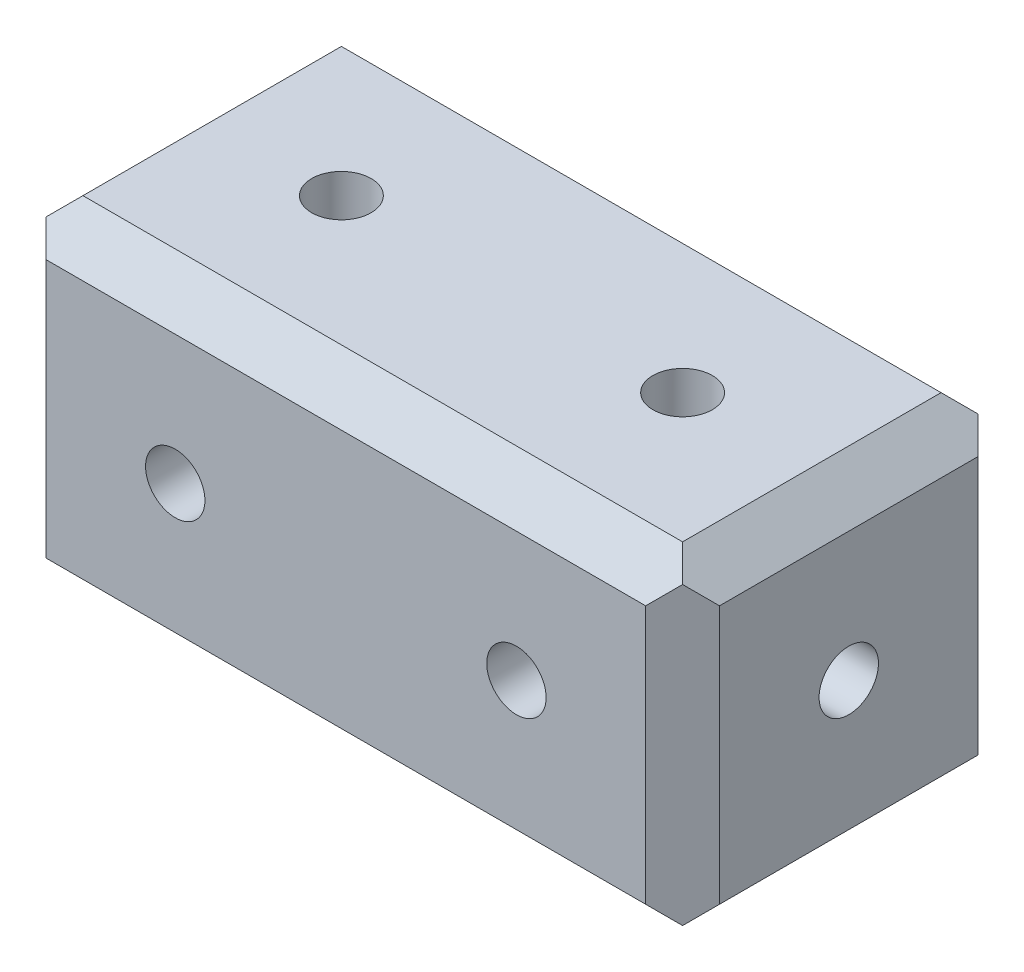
ISO-10303-21;
HEADER;
FILE_DESCRIPTION(('STEP AP214'),'2;1');
FILE_NAME('part.step','',(''),(''),'','','');
FILE_SCHEMA(('AUTOMOTIVE_DESIGN { 1 0 10303 214 1 1 1 1 }'));
ENDSEC;
DATA;
#1=APPLICATION_CONTEXT('core data for automotive mechanical design processes');
#2=APPLICATION_PROTOCOL_DEFINITION('international standard','automotive_design',2000,#1);
#3=PRODUCT_CONTEXT('',#1,'mechanical');
#4=PRODUCT('Part','Part','',(#3));
#5=PRODUCT_RELATED_PRODUCT_CATEGORY('part','',(#4));
#6=PRODUCT_DEFINITION_FORMATION('','',#4);
#7=PRODUCT_DEFINITION_CONTEXT('part definition',#1,'design');
#8=PRODUCT_DEFINITION('design','',#6,#7);
#9=PRODUCT_DEFINITION_SHAPE('','',#8);
#10=(LENGTH_UNIT() NAMED_UNIT(*) SI_UNIT(.MILLI.,.METRE.));
#11=(NAMED_UNIT(*) PLANE_ANGLE_UNIT() SI_UNIT($,.RADIAN.));
#12=(NAMED_UNIT(*) SI_UNIT($,.STERADIAN.) SOLID_ANGLE_UNIT());
#13=UNCERTAINTY_MEASURE_WITH_UNIT(LENGTH_MEASURE(1.E-05),#10,'distance_accuracy_value','');
#14=(GEOMETRIC_REPRESENTATION_CONTEXT(3) GLOBAL_UNCERTAINTY_ASSIGNED_CONTEXT((#13)) GLOBAL_UNIT_ASSIGNED_CONTEXT((#10,
#11,#12)) REPRESENTATION_CONTEXT('',''));
#15=CARTESIAN_POINT('',(0.,0.,0.));
#16=DIRECTION('',(0.,0.,1.));
#17=DIRECTION('',(1.,0.,0.));
#18=AXIS2_PLACEMENT_3D('',#15,#16,#17);
#19=CARTESIAN_POINT('',(0.,14.2875,0.));
#20=DIRECTION('',(0.,1.,0.));
#21=DIRECTION('',(0.,0.,1.));
#22=AXIS2_PLACEMENT_3D('',#19,#20,#21);
#23=CYLINDRICAL_SURFACE('',#22,2.5527);
#24=CARTESIAN_POINT('',(0.,14.2875,0.));
#25=DIRECTION('',(0.,1.,0.));
#26=DIRECTION('',(0.,0.,1.));
#27=AXIS2_PLACEMENT_3D('',#24,#25,#26);
#28=CIRCLE('',#27,2.5527);
#29=CARTESIAN_POINT('',(0.,14.2875,2.5527));
#30=VERTEX_POINT('',#29);
#31=EDGE_CURVE('E565',#30,#30,#28,.T.);
#32=ORIENTED_EDGE('',*,*,#31,.T.);
#33=EDGE_LOOP('',(#32));
#34=FACE_BOUND('',#33,.T.);
#35=CARTESIAN_POINT('',(0.,0.,0.));
#36=DIRECTION('',(0.,0.707106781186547,-0.707106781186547));
#37=DIRECTION('',(0.,0.707106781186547,0.707106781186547));
#38=AXIS2_PLACEMENT_3D('',#35,#36,#37);
#39=ELLIPSE('',#38,3.6100629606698,2.5527);
#40=CARTESIAN_POINT('',(1.8050314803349,1.8050314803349,1.8050314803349));
#41=VERTEX_POINT('',#40);
#42=CARTESIAN_POINT('',(-1.8050314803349,1.8050314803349,1.8050314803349));
#43=VERTEX_POINT('',#42);
#44=EDGE_CURVE('E572',#41,#43,#39,.F.);
#45=ORIENTED_EDGE('',*,*,#44,.T.);
#46=CARTESIAN_POINT('',(0.,0.,0.));
#47=DIRECTION('',(0.707106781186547,0.707106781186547,0.));
#48=DIRECTION('',(-0.707106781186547,0.707106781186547,0.));
#49=AXIS2_PLACEMENT_3D('',#46,#47,#48);
#50=ELLIPSE('',#49,3.6100629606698,2.5527);
#51=CARTESIAN_POINT('',(-1.8050314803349,1.8050314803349,-1.8050314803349));
#52=VERTEX_POINT('',#51);
#53=EDGE_CURVE('E549',#43,#52,#50,.F.);
#54=ORIENTED_EDGE('',*,*,#53,.T.);
#55=CARTESIAN_POINT('',(0.,0.,0.));
#56=DIRECTION('',(0.,0.707106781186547,0.707106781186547));
#57=DIRECTION('',(0.,0.707106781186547,-0.707106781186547));
#58=AXIS2_PLACEMENT_3D('',#55,#56,#57);
#59=ELLIPSE('',#58,3.6100629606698,2.5527);
#60=CARTESIAN_POINT('',(1.8050314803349,1.8050314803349,-1.8050314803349));
#61=VERTEX_POINT('',#60);
#62=EDGE_CURVE('E584',#52,#61,#59,.F.);
#63=ORIENTED_EDGE('',*,*,#62,.T.);
#64=CARTESIAN_POINT('',(0.,0.,0.));
#65=DIRECTION('',(-0.707106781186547,0.707106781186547,0.));
#66=DIRECTION('',(0.707106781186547,0.707106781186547,0.));
#67=AXIS2_PLACEMENT_3D('',#64,#65,#66);
#68=ELLIPSE('',#67,3.6100629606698,2.5527);
#69=EDGE_CURVE('E529',#61,#41,#68,.F.);
#70=ORIENTED_EDGE('',*,*,#69,.T.);
#71=EDGE_LOOP('',(#45,#54,#63,#70));
#72=FACE_BOUND('',#71,.T.);
#73=ADVANCED_FACE('F16',(#34,#72),#23,.F.);
#74=CARTESIAN_POINT('',(14.2875,-14.2875,14.2875));
#75=DIRECTION('',(0.,0.,1.));
#76=DIRECTION('',(1.,0.,0.));
#77=AXIS2_PLACEMENT_3D('',#74,#75,#76);
#78=PLANE('',#77);
#79=CARTESIAN_POINT('',(29.337,0.,14.2875));
#80=DIRECTION('',(0.,0.,1.));
#81=DIRECTION('',(1.,0.,0.));
#82=AXIS2_PLACEMENT_3D('',#79,#80,#81);
#83=CIRCLE('',#82,2.5527);
#84=CARTESIAN_POINT('',(31.8897,0.,14.2875));
#85=VERTEX_POINT('',#84);
#86=EDGE_CURVE('E525',#85,#85,#83,.T.);
#87=ORIENTED_EDGE('',*,*,#86,.F.);
#88=EDGE_LOOP('',(#87));
#89=FACE_BOUND('',#88,.T.);
#90=CARTESIAN_POINT('',(0.,0.,14.2875));
#91=DIRECTION('',(0.,0.,1.));
#92=DIRECTION('',(1.,0.,0.));
#93=AXIS2_PLACEMENT_3D('',#90,#91,#92);
#94=CIRCLE('',#93,2.5527);
#95=CARTESIAN_POINT('',(2.5527,0.,14.2875));
#96=VERTEX_POINT('',#95);
#97=EDGE_CURVE('E557',#96,#96,#94,.T.);
#98=ORIENTED_EDGE('',*,*,#97,.F.);
#99=EDGE_LOOP('',(#98));
#100=FACE_BOUND('',#99,.T.);
#101=DIRECTION('',(0.,-1.,0.));
#102=VECTOR('',#101,1.);
#103=CARTESIAN_POINT('',(-11.1125,-14.2875,14.2875));
#104=LINE('',#103,#102);
#105=CARTESIAN_POINT('',(-11.1125,11.1125,14.2875));
#106=VERTEX_POINT('',#105);
#107=CARTESIAN_POINT('',(-11.1125,-11.1125,14.2875));
#108=VERTEX_POINT('',#107);
#109=EDGE_CURVE('E271',#106,#108,#104,.T.);
#110=ORIENTED_EDGE('',*,*,#109,.T.);
#111=DIRECTION('',(1.,0.,0.));
#112=VECTOR('',#111,1.);
#113=CARTESIAN_POINT('',(14.2875,-11.1125,14.2875));
#114=LINE('',#113,#112);
#115=CARTESIAN_POINT('',(40.4495,-11.1125,14.2875));
#116=VERTEX_POINT('',#115);
#117=EDGE_CURVE('E362',#108,#116,#114,.T.);
#118=ORIENTED_EDGE('',*,*,#117,.T.);
#119=DIRECTION('',(0.,1.,0.));
#120=VECTOR('',#119,1.);
#121=CARTESIAN_POINT('',(40.4495,-14.2875,14.2875));
#122=LINE('',#121,#120);
#123=CARTESIAN_POINT('',(40.4495,11.1125,14.2875));
#124=VERTEX_POINT('',#123);
#125=EDGE_CURVE('E275',#116,#124,#122,.T.);
#126=ORIENTED_EDGE('',*,*,#125,.T.);
#127=DIRECTION('',(-1.,0.,0.));
#128=VECTOR('',#127,1.);
#129=CARTESIAN_POINT('',(14.2875,11.1125,14.2875));
#130=LINE('',#129,#128);
#131=EDGE_CURVE('E358',#124,#106,#130,.T.);
#132=ORIENTED_EDGE('',*,*,#131,.T.);
#133=EDGE_LOOP('',(#110,#118,#126,#132));
#134=FACE_BOUND('',#133,.T.);
#135=ADVANCED_FACE('F397',(#89,#100,#134),#78,.T.);
#136=CARTESIAN_POINT('',(14.2875,-14.2875,-14.2875));
#137=DIRECTION('',(0.,-1.,0.));
#138=DIRECTION('',(1.,0.,0.));
#139=AXIS2_PLACEMENT_3D('',#136,#137,#138);
#140=PLANE('',#139);
#141=CARTESIAN_POINT('',(29.337,-14.2875,1.49561100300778E-13));
#142=DIRECTION('',(0.,-1.,0.));
#143=DIRECTION('',(1.,0.,0.));
#144=AXIS2_PLACEMENT_3D('',#141,#142,#143);
#145=CIRCLE('',#144,2.5527);
#146=CARTESIAN_POINT('',(31.8897,-14.2875,1.49251163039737E-13));
#147=VERTEX_POINT('',#146);
#148=EDGE_CURVE('E506',#147,#147,#145,.T.);
#149=ORIENTED_EDGE('',*,*,#148,.F.);
#150=EDGE_LOOP('',(#149));
#151=FACE_BOUND('',#150,.T.);
#152=CARTESIAN_POINT('',(0.,-14.2875,0.));
#153=DIRECTION('',(0.,1.,0.));
#154=DIRECTION('',(0.,0.,1.));
#155=AXIS2_PLACEMENT_3D('',#152,#153,#154);
#156=CIRCLE('',#155,2.5527);
#157=CARTESIAN_POINT('',(0.,-14.2875,2.5527));
#158=VERTEX_POINT('',#157);
#159=EDGE_CURVE('E568',#158,#158,#156,.T.);
#160=ORIENTED_EDGE('',*,*,#159,.T.);
#161=EDGE_LOOP('',(#160));
#162=FACE_BOUND('',#161,.T.);
#163=DIRECTION('',(0.,0.,-1.));
#164=VECTOR('',#163,1.);
#165=CARTESIAN_POINT('',(-11.1125,-14.2875,-14.2875));
#166=LINE('',#165,#164);
#167=CARTESIAN_POINT('',(-11.1125,-14.2875,11.1125));
#168=VERTEX_POINT('',#167);
#169=CARTESIAN_POINT('',(-11.1125,-14.2875,-11.1125));
#170=VERTEX_POINT('',#169);
#171=EDGE_CURVE('E237',#168,#170,#166,.T.);
#172=ORIENTED_EDGE('',*,*,#171,.T.);
#173=DIRECTION('',(1.,0.,0.));
#174=VECTOR('',#173,1.);
#175=CARTESIAN_POINT('',(14.2875,-14.2875,-11.1125));
#176=LINE('',#175,#174);
#177=CARTESIAN_POINT('',(40.4495,-14.2875,-11.1125));
#178=VERTEX_POINT('',#177);
#179=EDGE_CURVE('E337',#170,#178,#176,.T.);
#180=ORIENTED_EDGE('',*,*,#179,.T.);
#181=DIRECTION('',(0.,0.,1.));
#182=VECTOR('',#181,1.);
#183=CARTESIAN_POINT('',(40.4495,-14.2875,-14.2875));
#184=LINE('',#183,#182);
#185=CARTESIAN_POINT('',(40.4495,-14.2875,11.1125));
#186=VERTEX_POINT('',#185);
#187=EDGE_CURVE('E233',#178,#186,#184,.T.);
#188=ORIENTED_EDGE('',*,*,#187,.T.);
#189=DIRECTION('',(-1.,0.,0.));
#190=VECTOR('',#189,1.);
#191=CARTESIAN_POINT('',(14.2875,-14.2875,11.1125));
#192=LINE('',#191,#190);
#193=EDGE_CURVE('E333',#186,#168,#192,.T.);
#194=ORIENTED_EDGE('',*,*,#193,.T.);
#195=EDGE_LOOP('',(#172,#180,#188,#194));
#196=FACE_BOUND('',#195,.T.);
#197=ADVANCED_FACE('F415',(#151,#162,#196),#140,.T.);
#198=CARTESIAN_POINT('',(14.2875,14.2875,-14.2875));
#199=DIRECTION('',(0.,0.,-1.));
#200=DIRECTION('',(-1.,0.,0.));
#201=AXIS2_PLACEMENT_3D('',#198,#199,#200);
#202=PLANE('',#201);
#203=CARTESIAN_POINT('',(29.337,0.,-14.2875));
#204=DIRECTION('',(0.,0.,-1.));
#205=DIRECTION('',(1.,0.,0.));
#206=AXIS2_PLACEMENT_3D('',#203,#204,#205);
#207=CIRCLE('',#206,2.5527);
#208=CARTESIAN_POINT('',(31.8897,0.,-14.2875));
#209=VERTEX_POINT('',#208);
#210=EDGE_CURVE('E511',#209,#209,#207,.T.);
#211=ORIENTED_EDGE('',*,*,#210,.F.);
#212=EDGE_LOOP('',(#211));
#213=FACE_BOUND('',#212,.T.);
#214=CARTESIAN_POINT('',(0.,0.,-14.2875));
#215=DIRECTION('',(0.,0.,-1.));
#216=DIRECTION('',(-1.,0.,0.));
#217=AXIS2_PLACEMENT_3D('',#214,#215,#216);
#218=CIRCLE('',#217,2.5527);
#219=CARTESIAN_POINT('',(-2.5527,0.,-14.2875));
#220=VERTEX_POINT('',#219);
#221=EDGE_CURVE('E561',#220,#220,#218,.T.);
#222=ORIENTED_EDGE('',*,*,#221,.F.);
#223=EDGE_LOOP('',(#222));
#224=FACE_BOUND('',#223,.T.);
#225=DIRECTION('',(0.,-1.,0.));
#226=VECTOR('',#225,1.);
#227=CARTESIAN_POINT('',(40.4495,14.2875,-14.2875));
#228=LINE('',#227,#226);
#229=CARTESIAN_POINT('',(40.4495,11.1125,-14.2875));
#230=VERTEX_POINT('',#229);
#231=CARTESIAN_POINT('',(40.4495,-11.1125,-14.2875));
#232=VERTEX_POINT('',#231);
#233=EDGE_CURVE('E290',#230,#232,#228,.T.);
#234=ORIENTED_EDGE('',*,*,#233,.T.);
#235=DIRECTION('',(-1.,0.,0.));
#236=VECTOR('',#235,1.);
#237=CARTESIAN_POINT('',(14.2875,-11.1125,-14.2875));
#238=LINE('',#237,#236);
#239=CARTESIAN_POINT('',(-11.1125,-11.1125,-14.2875));
#240=VERTEX_POINT('',#239);
#241=EDGE_CURVE('E317',#232,#240,#238,.T.);
#242=ORIENTED_EDGE('',*,*,#241,.T.);
#243=DIRECTION('',(0.,1.,0.));
#244=VECTOR('',#243,1.);
#245=CARTESIAN_POINT('',(-11.1125,14.2875,-14.2875));
#246=LINE('',#245,#244);
#247=CARTESIAN_POINT('',(-11.1125,11.1125,-14.2875));
#248=VERTEX_POINT('',#247);
#249=EDGE_CURVE('E286',#240,#248,#246,.T.);
#250=ORIENTED_EDGE('',*,*,#249,.T.);
#251=DIRECTION('',(1.,0.,0.));
#252=VECTOR('',#251,1.);
#253=CARTESIAN_POINT('',(14.2875,11.1125,-14.2875));
#254=LINE('',#253,#252);
#255=EDGE_CURVE('E314',#248,#230,#254,.T.);
#256=ORIENTED_EDGE('',*,*,#255,.T.);
#257=EDGE_LOOP('',(#234,#242,#250,#256));
#258=FACE_BOUND('',#257,.T.);
#259=ADVANCED_FACE('F433',(#213,#224,#258),#202,.T.);
#260=CARTESIAN_POINT('',(14.2875,14.2875,14.2875));
#261=DIRECTION('',(0.,1.,0.));
#262=DIRECTION('',(-1.,0.,0.));
#263=AXIS2_PLACEMENT_3D('',#260,#261,#262);
#264=PLANE('',#263);
#265=CARTESIAN_POINT('',(29.337,14.2875,0.));
#266=DIRECTION('',(0.,1.,0.));
#267=DIRECTION('',(1.,0.,0.));
#268=AXIS2_PLACEMENT_3D('',#265,#266,#267);
#269=CIRCLE('',#268,2.5527);
#270=CARTESIAN_POINT('',(31.8897,14.2875,0.));
#271=VERTEX_POINT('',#270);
#272=EDGE_CURVE('E521',#271,#271,#269,.T.);
#273=ORIENTED_EDGE('',*,*,#272,.F.);
#274=EDGE_LOOP('',(#273));
#275=FACE_BOUND('',#274,.T.);
#276=ORIENTED_EDGE('',*,*,#31,.F.);
#277=EDGE_LOOP('',(#276));
#278=FACE_BOUND('',#277,.T.);
#279=DIRECTION('',(0.,0.,-1.));
#280=VECTOR('',#279,1.);
#281=CARTESIAN_POINT('',(40.4495,14.2875,14.2875));
#282=LINE('',#281,#280);
#283=CARTESIAN_POINT('',(40.4495,14.2875,11.1125));
#284=VERTEX_POINT('',#283);
#285=CARTESIAN_POINT('',(40.4495,14.2875,-11.1125));
#286=VERTEX_POINT('',#285);
#287=EDGE_CURVE('E252',#284,#286,#282,.T.);
#288=ORIENTED_EDGE('',*,*,#287,.T.);
#289=DIRECTION('',(-1.,0.,0.));
#290=VECTOR('',#289,1.);
#291=CARTESIAN_POINT('',(14.2875,14.2875,-11.1125));
#292=LINE('',#291,#290);
#293=CARTESIAN_POINT('',(-11.1125,14.2875,-11.1125));
#294=VERTEX_POINT('',#293);
#295=EDGE_CURVE('E374',#286,#294,#292,.T.);
#296=ORIENTED_EDGE('',*,*,#295,.T.);
#297=DIRECTION('',(0.,0.,1.));
#298=VECTOR('',#297,1.);
#299=CARTESIAN_POINT('',(-11.1125,14.2875,14.2875));
#300=LINE('',#299,#298);
#301=CARTESIAN_POINT('',(-11.1125,14.2875,11.1125));
#302=VERTEX_POINT('',#301);
#303=EDGE_CURVE('E249',#294,#302,#300,.T.);
#304=ORIENTED_EDGE('',*,*,#303,.T.);
#305=DIRECTION('',(1.,0.,0.));
#306=VECTOR('',#305,1.);
#307=CARTESIAN_POINT('',(14.2875,14.2875,11.1125));
#308=LINE('',#307,#306);
#309=EDGE_CURVE('E371',#302,#284,#308,.T.);
#310=ORIENTED_EDGE('',*,*,#309,.T.);
#311=EDGE_LOOP('',(#288,#296,#304,#310));
#312=FACE_BOUND('',#311,.T.);
#313=ADVANCED_FACE('F443',(#275,#278,#312),#264,.T.);
#314=CARTESIAN_POINT('',(-14.2875,0.,0.));
#315=DIRECTION('',(-1.,0.,0.));
#316=DIRECTION('',(0.,-1.,0.));
#317=AXIS2_PLACEMENT_3D('',#314,#315,#316);
#318=PLANE('',#317);
#319=CARTESIAN_POINT('',(-14.2875,0.,0.));
#320=DIRECTION('',(-1.,0.,0.));
#321=DIRECTION('',(0.,-1.,0.));
#322=AXIS2_PLACEMENT_3D('',#319,#320,#321);
#323=CIRCLE('',#322,2.5527);
#324=CARTESIAN_POINT('',(-14.2875,-2.5527,0.));
#325=VERTEX_POINT('',#324);
#326=EDGE_CURVE('E553',#325,#325,#323,.T.);
#327=ORIENTED_EDGE('',*,*,#326,.F.);
#328=EDGE_LOOP('',(#327));
#329=FACE_BOUND('',#328,.T.);
#330=DIRECTION('',(0.,0.,1.));
#331=VECTOR('',#330,1.);
#332=CARTESIAN_POINT('',(-14.2875,-11.1125,0.));
#333=LINE('',#332,#331);
#334=CARTESIAN_POINT('',(-14.2875,-11.1125,-11.1125));
#335=VERTEX_POINT('',#334);
#336=CARTESIAN_POINT('',(-14.2875,-11.1125,11.1125));
#337=VERTEX_POINT('',#336);
#338=EDGE_CURVE('E229',#335,#337,#333,.T.);
#339=ORIENTED_EDGE('',*,*,#338,.T.);
#340=DIRECTION('',(0.,1.,0.));
#341=VECTOR('',#340,1.);
#342=CARTESIAN_POINT('',(-14.2875,0.,11.1125));
#343=LINE('',#342,#341);
#344=CARTESIAN_POINT('',(-14.2875,11.1125,11.1125));
#345=VERTEX_POINT('',#344);
#346=EDGE_CURVE('E298',#337,#345,#343,.T.);
#347=ORIENTED_EDGE('',*,*,#346,.T.);
#348=DIRECTION('',(0.,0.,-1.));
#349=VECTOR('',#348,1.);
#350=CARTESIAN_POINT('',(-14.2875,11.1125,0.));
#351=LINE('',#350,#349);
#352=CARTESIAN_POINT('',(-14.2875,11.1125,-11.1125));
#353=VERTEX_POINT('',#352);
#354=EDGE_CURVE('E225',#345,#353,#351,.T.);
#355=ORIENTED_EDGE('',*,*,#354,.T.);
#356=DIRECTION('',(0.,-1.,0.));
#357=VECTOR('',#356,1.);
#358=CARTESIAN_POINT('',(-14.2875,0.,-11.1125));
#359=LINE('',#358,#357);
#360=EDGE_CURVE('E294',#353,#335,#359,.T.);
#361=ORIENTED_EDGE('',*,*,#360,.T.);
#362=EDGE_LOOP('',(#339,#347,#355,#361));
#363=FACE_BOUND('',#362,.T.);
#364=ADVANCED_FACE('F447',(#329,#363),#318,.T.);
#365=CARTESIAN_POINT('',(0.,0.,0.));
#366=DIRECTION('',(0.,0.707106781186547,0.707106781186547));
#367=DIRECTION('',(0.,0.707106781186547,-0.707106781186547));
#368=AXIS2_PLACEMENT_3D('',#365,#366,#367);
#369=ELLIPSE('',#368,3.6100629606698,2.5527);
#370=CARTESIAN_POINT('',(-1.8050314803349,-1.8050314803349,1.8050314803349));
#371=VERTEX_POINT('',#370);
#372=CARTESIAN_POINT('',(1.8050314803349,-1.8050314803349,1.8050314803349));
#373=VERTEX_POINT('',#372);
#374=EDGE_CURVE('E580',#371,#373,#369,.T.);
#375=ORIENTED_EDGE('',*,*,#374,.T.);
#376=CARTESIAN_POINT('',(0.,0.,0.));
#377=DIRECTION('',(0.707106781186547,0.707106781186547,0.));
#378=DIRECTION('',(-0.707106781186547,0.707106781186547,0.));
#379=AXIS2_PLACEMENT_3D('',#376,#377,#378);
#380=ELLIPSE('',#379,3.6100629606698,2.5527);
#381=CARTESIAN_POINT('',(1.8050314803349,-1.8050314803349,-1.8050314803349));
#382=VERTEX_POINT('',#381);
#383=EDGE_CURVE('E533',#373,#382,#380,.T.);
#384=ORIENTED_EDGE('',*,*,#383,.T.);
#385=CARTESIAN_POINT('',(0.,0.,0.));
#386=DIRECTION('',(0.,0.707106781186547,-0.707106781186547));
#387=DIRECTION('',(0.,0.707106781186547,0.707106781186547));
#388=AXIS2_PLACEMENT_3D('',#385,#386,#387);
#389=ELLIPSE('',#388,3.6100629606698,2.5527);
#390=CARTESIAN_POINT('',(-1.8050314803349,-1.8050314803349,-1.8050314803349));
#391=VERTEX_POINT('',#390);
#392=EDGE_CURVE('E576',#382,#391,#389,.T.);
#393=ORIENTED_EDGE('',*,*,#392,.T.);
#394=CARTESIAN_POINT('',(0.,0.,0.));
#395=DIRECTION('',(-0.707106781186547,0.707106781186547,0.));
#396=DIRECTION('',(0.707106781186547,0.707106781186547,0.));
#397=AXIS2_PLACEMENT_3D('',#394,#395,#396);
#398=ELLIPSE('',#397,3.6100629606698,2.5527);
#399=EDGE_CURVE('E545',#391,#371,#398,.T.);
#400=ORIENTED_EDGE('',*,*,#399,.T.);
#401=EDGE_LOOP('',(#375,#384,#393,#400));
#402=FACE_BOUND('',#401,.T.);
#403=ORIENTED_EDGE('',*,*,#159,.F.);
#404=EDGE_LOOP('',(#403));
#405=FACE_BOUND('',#404,.T.);
#406=ADVANCED_FACE('F449',(#402,#405),#23,.F.);
#407=CARTESIAN_POINT('',(0.,0.,14.2875));
#408=DIRECTION('',(0.,0.,1.));
#409=DIRECTION('',(1.,0.,0.));
#410=AXIS2_PLACEMENT_3D('',#407,#408,#409);
#411=CYLINDRICAL_SURFACE('',#410,2.5527);
#412=ORIENTED_EDGE('',*,*,#97,.T.);
#413=EDGE_LOOP('',(#412));
#414=FACE_BOUND('',#413,.T.);
#415=ORIENTED_EDGE('',*,*,#374,.F.);
#416=CARTESIAN_POINT('',(0.,0.,0.));
#417=DIRECTION('',(0.707106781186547,0.,0.707106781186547));
#418=DIRECTION('',(-0.707106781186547,0.,0.707106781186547));
#419=AXIS2_PLACEMENT_3D('',#416,#417,#418);
#420=ELLIPSE('',#419,3.6100629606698,2.5527);
#421=EDGE_CURVE('E216',#371,#43,#420,.F.);
#422=ORIENTED_EDGE('',*,*,#421,.T.);
#423=ORIENTED_EDGE('',*,*,#44,.F.);
#424=CARTESIAN_POINT('',(0.,0.,0.));
#425=DIRECTION('',(-0.707106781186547,0.,0.707106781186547));
#426=DIRECTION('',(0.707106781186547,0.,0.707106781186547));
#427=AXIS2_PLACEMENT_3D('',#424,#425,#426);
#428=ELLIPSE('',#427,3.6100629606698,2.5527);
#429=EDGE_CURVE('E587',#41,#373,#428,.F.);
#430=ORIENTED_EDGE('',*,*,#429,.T.);
#431=EDGE_LOOP('',(#415,#422,#423,#430));
#432=FACE_BOUND('',#431,.T.);
#433=ADVANCED_FACE('F457',(#414,#432),#411,.F.);
#434=ORIENTED_EDGE('',*,*,#221,.T.);
#435=EDGE_LOOP('',(#434));
#436=FACE_BOUND('',#435,.T.);
#437=ORIENTED_EDGE('',*,*,#392,.F.);
#438=CARTESIAN_POINT('',(0.,0.,0.));
#439=DIRECTION('',(0.707106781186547,0.,0.707106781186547));
#440=DIRECTION('',(-0.707106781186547,0.,0.707106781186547));
#441=AXIS2_PLACEMENT_3D('',#438,#439,#440);
#442=ELLIPSE('',#441,3.6100629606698,2.5527);
#443=EDGE_CURVE('E537',#382,#61,#442,.T.);
#444=ORIENTED_EDGE('',*,*,#443,.T.);
#445=ORIENTED_EDGE('',*,*,#62,.F.);
#446=CARTESIAN_POINT('',(0.,0.,0.));
#447=DIRECTION('',(-0.707106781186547,0.,0.707106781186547));
#448=DIRECTION('',(0.707106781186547,0.,0.707106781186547));
#449=AXIS2_PLACEMENT_3D('',#446,#447,#448);
#450=ELLIPSE('',#449,3.6100629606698,2.5527);
#451=EDGE_CURVE('E541',#52,#391,#450,.T.);
#452=ORIENTED_EDGE('',*,*,#451,.T.);
#453=EDGE_LOOP('',(#437,#444,#445,#452));
#454=FACE_BOUND('',#453,.T.);
#455=ADVANCED_FACE('F474',(#436,#454),#411,.F.);
#456=CARTESIAN_POINT('',(14.2875,0.,0.));
#457=DIRECTION('',(1.,0.,0.));
#458=DIRECTION('',(0.,0.,-1.));
#459=AXIS2_PLACEMENT_3D('',#456,#457,#458);
#460=CYLINDRICAL_SURFACE('',#459,2.5527);
#461=ORIENTED_EDGE('',*,*,#383,.F.);
#462=ORIENTED_EDGE('',*,*,#429,.F.);
#463=ORIENTED_EDGE('',*,*,#69,.F.);
#464=ORIENTED_EDGE('',*,*,#443,.F.);
#465=EDGE_LOOP('',(#461,#462,#463,#464));
#466=FACE_BOUND('',#465,.T.);
#467=CARTESIAN_POINT('',(29.337,0.,0.));
#468=DIRECTION('',(-0.707106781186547,0.,0.707106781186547));
#469=DIRECTION('',(0.707106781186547,0.,0.707106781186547));
#470=AXIS2_PLACEMENT_3D('',#467,#468,#469);
#471=ELLIPSE('',#470,3.6100629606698,2.5527);
#472=CARTESIAN_POINT('',(27.5319685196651,1.8050314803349,-1.8050314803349));
#473=VERTEX_POINT('',#472);
#474=CARTESIAN_POINT('',(27.5319685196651,-1.8050314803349,-1.8050314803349));
#475=VERTEX_POINT('',#474);
#476=EDGE_CURVE('E191',#473,#475,#471,.T.);
#477=ORIENTED_EDGE('',*,*,#476,.F.);
#478=CARTESIAN_POINT('',(29.337,0.,0.));
#479=DIRECTION('',(0.707106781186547,0.707106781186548,0.));
#480=DIRECTION('',(-0.707106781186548,0.707106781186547,0.));
#481=AXIS2_PLACEMENT_3D('',#478,#479,#480);
#482=ELLIPSE('',#481,3.6100629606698,2.5527);
#483=CARTESIAN_POINT('',(27.5319685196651,1.8050314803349,1.80503148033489));
#484=VERTEX_POINT('',#483);
#485=EDGE_CURVE('E848',#484,#473,#482,.F.);
#486=ORIENTED_EDGE('',*,*,#485,.F.);
#487=CARTESIAN_POINT('',(29.337,0.,0.));
#488=DIRECTION('',(0.707106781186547,0.,0.707106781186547));
#489=DIRECTION('',(-0.707106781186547,0.,0.707106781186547));
#490=AXIS2_PLACEMENT_3D('',#487,#488,#489);
#491=ELLIPSE('',#490,3.6100629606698,2.5527);
#492=CARTESIAN_POINT('',(27.5319685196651,-1.80503148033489,1.8050314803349));
#493=VERTEX_POINT('',#492);
#494=EDGE_CURVE('E514',#493,#484,#491,.F.);
#495=ORIENTED_EDGE('',*,*,#494,.F.);
#496=CARTESIAN_POINT('',(29.337,0.,0.));
#497=DIRECTION('',(-0.707106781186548,0.707106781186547,0.));
#498=DIRECTION('',(0.707106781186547,0.707106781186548,0.));
#499=AXIS2_PLACEMENT_3D('',#496,#497,#498);
#500=ELLIPSE('',#499,3.6100629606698,2.5527);
#501=EDGE_CURVE('E507',#475,#493,#500,.T.);
#502=ORIENTED_EDGE('',*,*,#501,.F.);
#503=EDGE_LOOP('',(#477,#486,#495,#502));
#504=FACE_BOUND('',#503,.T.);
#505=ADVANCED_FACE('F477',(#466,#504),#460,.F.);
#506=ORIENTED_EDGE('',*,*,#326,.T.);
#507=EDGE_LOOP('',(#506));
#508=FACE_BOUND('',#507,.T.);
#509=ORIENTED_EDGE('',*,*,#421,.F.);
#510=ORIENTED_EDGE('',*,*,#399,.F.);
#511=ORIENTED_EDGE('',*,*,#451,.F.);
#512=ORIENTED_EDGE('',*,*,#53,.F.);
#513=EDGE_LOOP('',(#509,#510,#511,#512));
#514=FACE_BOUND('',#513,.T.);
#515=ADVANCED_FACE('F479',(#508,#514),#460,.F.);
#516=CARTESIAN_POINT('',(43.6245,0.,0.));
#517=DIRECTION('',(1.,0.,0.));
#518=DIRECTION('',(0.,1.,0.));
#519=AXIS2_PLACEMENT_3D('',#516,#517,#518);
#520=PLANE('',#519);
#521=CARTESIAN_POINT('',(43.6245,0.,0.));
#522=DIRECTION('',(1.,0.,0.));
#523=DIRECTION('',(0.,1.,0.));
#524=AXIS2_PLACEMENT_3D('',#521,#522,#523);
#525=CIRCLE('',#524,2.5527);
#526=CARTESIAN_POINT('',(43.6245,2.5527,0.));
#527=VERTEX_POINT('',#526);
#528=EDGE_CURVE('E504',#527,#527,#525,.T.);
#529=ORIENTED_EDGE('',*,*,#528,.F.);
#530=EDGE_LOOP('',(#529));
#531=FACE_BOUND('',#530,.T.);
#532=DIRECTION('',(0.,0.,1.));
#533=VECTOR('',#532,1.);
#534=CARTESIAN_POINT('',(43.6245,11.1125,0.));
#535=LINE('',#534,#533);
#536=CARTESIAN_POINT('',(43.6245,11.1125,-11.1125));
#537=VERTEX_POINT('',#536);
#538=CARTESIAN_POINT('',(43.6245,11.1125,11.1125));
#539=VERTEX_POINT('',#538);
#540=EDGE_CURVE('E241',#537,#539,#535,.T.);
#541=ORIENTED_EDGE('',*,*,#540,.T.);
#542=DIRECTION('',(0.,-1.,0.));
#543=VECTOR('',#542,1.);
#544=CARTESIAN_POINT('',(43.6245,0.,11.1125));
#545=LINE('',#544,#543);
#546=CARTESIAN_POINT('',(43.6245,-11.1125,11.1125));
#547=VERTEX_POINT('',#546);
#548=EDGE_CURVE('E260',#539,#547,#545,.T.);
#549=ORIENTED_EDGE('',*,*,#548,.T.);
#550=DIRECTION('',(0.,0.,-1.));
#551=VECTOR('',#550,1.);
#552=CARTESIAN_POINT('',(43.6245,-11.1125,0.));
#553=LINE('',#552,#551);
#554=CARTESIAN_POINT('',(43.6245,-11.1125,-11.1125));
#555=VERTEX_POINT('',#554);
#556=EDGE_CURVE('E245',#547,#555,#553,.T.);
#557=ORIENTED_EDGE('',*,*,#556,.T.);
#558=DIRECTION('',(0.,1.,0.));
#559=VECTOR('',#558,1.);
#560=CARTESIAN_POINT('',(43.6245,0.,-11.1125));
#561=LINE('',#560,#559);
#562=EDGE_CURVE('E256',#555,#537,#561,.T.);
#563=ORIENTED_EDGE('',*,*,#562,.T.);
#564=EDGE_LOOP('',(#541,#549,#557,#563));
#565=FACE_BOUND('',#564,.T.);
#566=ADVANCED_FACE('F482',(#531,#565),#520,.T.);
#567=CARTESIAN_POINT('',(29.337,0.,14.2875));
#568=DIRECTION('',(0.,0.,1.));
#569=DIRECTION('',(1.,0.,0.));
#570=AXIS2_PLACEMENT_3D('',#567,#568,#569);
#571=CYLINDRICAL_SURFACE('',#570,2.5527);
#572=CARTESIAN_POINT('',(29.337,0.,0.));
#573=DIRECTION('',(0.,-0.707106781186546,0.707106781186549));
#574=DIRECTION('',(0.,0.707106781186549,0.707106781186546));
#575=AXIS2_PLACEMENT_3D('',#572,#573,#574);
#576=ELLIPSE('',#575,3.61006296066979,2.5527);
#577=CARTESIAN_POINT('',(31.1420314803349,1.8050314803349,1.80503148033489));
#578=VERTEX_POINT('',#577);
#579=EDGE_CURVE('E192',#484,#578,#576,.F.);
#580=ORIENTED_EDGE('',*,*,#579,.T.);
#581=CARTESIAN_POINT('',(29.337,0.,0.));
#582=DIRECTION('',(-0.707106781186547,0.,0.707106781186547));
#583=DIRECTION('',(0.707106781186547,0.,0.707106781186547));
#584=AXIS2_PLACEMENT_3D('',#581,#582,#583);
#585=ELLIPSE('',#584,3.6100629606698,2.5527);
#586=CARTESIAN_POINT('',(31.1420314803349,-1.80503148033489,1.8050314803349));
#587=VERTEX_POINT('',#586);
#588=EDGE_CURVE('E853',#578,#587,#585,.F.);
#589=ORIENTED_EDGE('',*,*,#588,.T.);
#590=CARTESIAN_POINT('',(29.337,0.,0.));
#591=DIRECTION('',(0.,0.707106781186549,0.707106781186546));
#592=DIRECTION('',(0.,-0.707106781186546,0.707106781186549));
#593=AXIS2_PLACEMENT_3D('',#590,#591,#592);
#594=ELLIPSE('',#593,3.6100629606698,2.5527);
#595=EDGE_CURVE('E201',#587,#493,#594,.F.);
#596=ORIENTED_EDGE('',*,*,#595,.T.);
#597=ORIENTED_EDGE('',*,*,#494,.T.);
#598=EDGE_LOOP('',(#580,#589,#596,#597));
#599=FACE_BOUND('',#598,.T.);
#600=ORIENTED_EDGE('',*,*,#86,.T.);
#601=EDGE_LOOP('',(#600));
#602=FACE_BOUND('',#601,.T.);
#603=ADVANCED_FACE('F486',(#599,#602),#571,.F.);
#604=CARTESIAN_POINT('',(29.337,14.2875,0.));
#605=DIRECTION('',(0.,1.,0.));
#606=DIRECTION('',(1.,0.,0.));
#607=AXIS2_PLACEMENT_3D('',#604,#605,#606);
#608=CYLINDRICAL_SURFACE('',#607,2.5527);
#609=ORIENTED_EDGE('',*,*,#272,.T.);
#610=EDGE_LOOP('',(#609));
#611=FACE_BOUND('',#610,.T.);
#612=CARTESIAN_POINT('',(29.337,0.,0.));
#613=DIRECTION('',(0.,0.707106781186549,0.707106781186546));
#614=DIRECTION('',(0.,-0.707106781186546,0.707106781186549));
#615=AXIS2_PLACEMENT_3D('',#612,#613,#614);
#616=ELLIPSE('',#615,3.6100629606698,2.5527);
#617=CARTESIAN_POINT('',(31.1420314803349,1.8050314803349,-1.8050314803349));
#618=VERTEX_POINT('',#617);
#619=EDGE_CURVE('E208',#618,#473,#616,.T.);
#620=ORIENTED_EDGE('',*,*,#619,.F.);
#621=CARTESIAN_POINT('',(29.337,0.,0.));
#622=DIRECTION('',(-0.707106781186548,0.707106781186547,0.));
#623=DIRECTION('',(0.707106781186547,0.707106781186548,0.));
#624=AXIS2_PLACEMENT_3D('',#621,#622,#623);
#625=ELLIPSE('',#624,3.6100629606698,2.5527);
#626=EDGE_CURVE('E185',#618,#578,#625,.F.);
#627=ORIENTED_EDGE('',*,*,#626,.T.);
#628=ORIENTED_EDGE('',*,*,#579,.F.);
#629=ORIENTED_EDGE('',*,*,#485,.T.);
#630=EDGE_LOOP('',(#620,#627,#628,#629));
#631=FACE_BOUND('',#630,.T.);
#632=ADVANCED_FACE('F490',(#611,#631),#608,.F.);
#633=ORIENTED_EDGE('',*,*,#148,.T.);
#634=EDGE_LOOP('',(#633));
#635=FACE_BOUND('',#634,.T.);
#636=CARTESIAN_POINT('',(29.337,0.,0.));
#637=DIRECTION('',(0.,-0.707106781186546,0.707106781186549));
#638=DIRECTION('',(0.,0.707106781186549,0.707106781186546));
#639=AXIS2_PLACEMENT_3D('',#636,#637,#638);
#640=ELLIPSE('',#639,3.61006296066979,2.5527);
#641=CARTESIAN_POINT('',(31.1420314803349,-1.8050314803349,-1.8050314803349));
#642=VERTEX_POINT('',#641);
#643=EDGE_CURVE('E199',#475,#642,#640,.T.);
#644=ORIENTED_EDGE('',*,*,#643,.F.);
#645=ORIENTED_EDGE('',*,*,#501,.T.);
#646=ORIENTED_EDGE('',*,*,#595,.F.);
#647=CARTESIAN_POINT('',(29.337,0.,0.));
#648=DIRECTION('',(0.707106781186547,0.707106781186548,0.));
#649=DIRECTION('',(-0.707106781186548,0.707106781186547,0.));
#650=AXIS2_PLACEMENT_3D('',#647,#648,#649);
#651=ELLIPSE('',#650,3.6100629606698,2.5527);
#652=EDGE_CURVE('E182',#587,#642,#651,.T.);
#653=ORIENTED_EDGE('',*,*,#652,.T.);
#654=EDGE_LOOP('',(#644,#645,#646,#653));
#655=FACE_BOUND('',#654,.T.);
#656=ADVANCED_FACE('F197',(#635,#655),#608,.F.);
#657=ORIENTED_EDGE('',*,*,#619,.T.);
#658=ORIENTED_EDGE('',*,*,#476,.T.);
#659=ORIENTED_EDGE('',*,*,#643,.T.);
#660=CARTESIAN_POINT('',(29.337,0.,0.));
#661=DIRECTION('',(0.707106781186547,0.,0.707106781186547));
#662=DIRECTION('',(-0.707106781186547,0.,0.707106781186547));
#663=AXIS2_PLACEMENT_3D('',#660,#661,#662);
#664=ELLIPSE('',#663,3.6100629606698,2.5527);
#665=EDGE_CURVE('E179',#642,#618,#664,.T.);
#666=ORIENTED_EDGE('',*,*,#665,.T.);
#667=EDGE_LOOP('',(#657,#658,#659,#666));
#668=FACE_BOUND('',#667,.T.);
#669=ORIENTED_EDGE('',*,*,#210,.T.);
#670=EDGE_LOOP('',(#669));
#671=FACE_BOUND('',#670,.T.);
#672=ADVANCED_FACE('F205',(#668,#671),#571,.F.);
#673=CARTESIAN_POINT('',(15.8115,0.,0.));
#674=DIRECTION('',(-1.,0.,0.));
#675=DIRECTION('',(0.,0.,1.));
#676=AXIS2_PLACEMENT_3D('',#673,#674,#675);
#677=CYLINDRICAL_SURFACE('',#676,2.5527);
#678=ORIENTED_EDGE('',*,*,#528,.T.);
#679=EDGE_LOOP('',(#678));
#680=FACE_BOUND('',#679,.T.);
#681=ORIENTED_EDGE('',*,*,#626,.F.);
#682=ORIENTED_EDGE('',*,*,#665,.F.);
#683=ORIENTED_EDGE('',*,*,#652,.F.);
#684=ORIENTED_EDGE('',*,*,#588,.F.);
#685=EDGE_LOOP('',(#681,#682,#683,#684));
#686=FACE_BOUND('',#685,.T.);
#687=ADVANCED_FACE('F181',(#680,#686),#677,.F.);
#688=CARTESIAN_POINT('',(-14.2875,-11.1125,0.));
#689=DIRECTION('',(0.707106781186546,0.707106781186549,0.));
#690=DIRECTION('',(0.,0.,1.));
#691=AXIS2_PLACEMENT_3D('',#688,#689,#690);
#692=PLANE('',#691);
#693=DIRECTION('',(0.577350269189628,-0.577350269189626,-0.577350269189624));
#694=VECTOR('',#693,1.);
#695=CARTESIAN_POINT('',(-17.9916666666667,-7.40833333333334,-7.40833333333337));
#696=LINE('',#695,#694);
#697=CARTESIAN_POINT('',(-12.7,-12.7,-12.7));
#698=VERTEX_POINT('',#697);
#699=EDGE_CURVE('E307',#335,#698,#696,.T.);
#700=ORIENTED_EDGE('',*,*,#699,.T.);
#701=DIRECTION('',(0.577350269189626,-0.577350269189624,0.577350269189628));
#702=VECTOR('',#701,1.);
#703=CARTESIAN_POINT('',(-9.52499999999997,-15.875,-9.52499999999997));
#704=LINE('',#703,#702);
#705=EDGE_CURVE('E330',#698,#170,#704,.T.);
#706=ORIENTED_EDGE('',*,*,#705,.T.);
#707=ORIENTED_EDGE('',*,*,#171,.F.);
#708=DIRECTION('',(-0.577350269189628,0.577350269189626,0.577350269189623));
#709=VECTOR('',#708,1.);
#710=CARTESIAN_POINT('',(-9.525,-15.875,9.52500000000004));
#711=LINE('',#710,#709);
#712=CARTESIAN_POINT('',(-12.7,-12.7,12.7));
#713=VERTEX_POINT('',#712);
#714=EDGE_CURVE('E327',#168,#713,#711,.T.);
#715=ORIENTED_EDGE('',*,*,#714,.T.);
#716=DIRECTION('',(-0.577350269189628,0.577350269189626,-0.577350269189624));
#717=VECTOR('',#716,1.);
#718=CARTESIAN_POINT('',(-17.9916666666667,-7.40833333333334,7.40833333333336));
#719=LINE('',#718,#717);
#720=EDGE_CURVE('E311',#713,#337,#719,.T.);
#721=ORIENTED_EDGE('',*,*,#720,.T.);
#722=ORIENTED_EDGE('',*,*,#338,.F.);
#723=EDGE_LOOP('',(#700,#706,#707,#715,#721,#722));
#724=FACE_BOUND('',#723,.T.);
#725=ADVANCED_FACE('F418',(#724),#692,.F.);
#726=CARTESIAN_POINT('',(43.6245,-11.1125,0.));
#727=DIRECTION('',(-0.707106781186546,0.707106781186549,0.));
#728=DIRECTION('',(0.,0.,-1.));
#729=AXIS2_PLACEMENT_3D('',#726,#727,#728);
#730=PLANE('',#729);
#731=ORIENTED_EDGE('',*,*,#187,.F.);
#732=DIRECTION('',(0.577350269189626,0.577350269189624,-0.577350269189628));
#733=VECTOR('',#732,1.);
#734=CARTESIAN_POINT('',(38.862,-15.875,-9.52499999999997));
#735=LINE('',#734,#733);
#736=CARTESIAN_POINT('',(42.037,-12.7,-12.7));
#737=VERTEX_POINT('',#736);
#738=EDGE_CURVE('E343',#178,#737,#735,.T.);
#739=ORIENTED_EDGE('',*,*,#738,.T.);
#740=DIRECTION('',(0.577350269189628,0.577350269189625,0.577350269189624));
#741=VECTOR('',#740,1.);
#742=CARTESIAN_POINT('',(47.3286666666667,-7.40833333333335,-7.40833333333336));
#743=LINE('',#742,#741);
#744=EDGE_CURVE('E264',#737,#555,#743,.T.);
#745=ORIENTED_EDGE('',*,*,#744,.T.);
#746=ORIENTED_EDGE('',*,*,#556,.F.);
#747=DIRECTION('',(-0.577350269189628,-0.577350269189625,0.577350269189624));
#748=VECTOR('',#747,1.);
#749=CARTESIAN_POINT('',(47.3286666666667,-7.40833333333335,7.40833333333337));
#750=LINE('',#749,#748);
#751=CARTESIAN_POINT('',(42.037,-12.7,12.7));
#752=VERTEX_POINT('',#751);
#753=EDGE_CURVE('E267',#547,#752,#750,.T.);
#754=ORIENTED_EDGE('',*,*,#753,.T.);
#755=DIRECTION('',(-0.577350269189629,-0.577350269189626,-0.577350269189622));
#756=VECTOR('',#755,1.);
#757=CARTESIAN_POINT('',(38.862,-15.875,9.52500000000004));
#758=LINE('',#757,#756);
#759=EDGE_CURVE('E340',#752,#186,#758,.T.);
#760=ORIENTED_EDGE('',*,*,#759,.T.);
#761=EDGE_LOOP('',(#731,#739,#745,#746,#754,#760));
#762=FACE_BOUND('',#761,.T.);
#763=ADVANCED_FACE('F412',(#762),#730,.F.);
#764=CARTESIAN_POINT('',(43.6245,11.1125,0.));
#765=DIRECTION('',(-0.707106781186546,-0.707106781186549,0.));
#766=DIRECTION('',(0.,0.,1.));
#767=AXIS2_PLACEMENT_3D('',#764,#765,#766);
#768=PLANE('',#767);
#769=DIRECTION('',(-0.577350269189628,0.577350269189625,-0.577350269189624));
#770=VECTOR('',#769,1.);
#771=CARTESIAN_POINT('',(47.3286666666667,7.40833333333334,-7.40833333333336));
#772=LINE('',#771,#770);
#773=CARTESIAN_POINT('',(42.037,12.7,-12.7));
#774=VERTEX_POINT('',#773);
#775=EDGE_CURVE('E279',#537,#774,#772,.T.);
#776=ORIENTED_EDGE('',*,*,#775,.T.);
#777=DIRECTION('',(-0.577350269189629,0.577350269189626,0.577350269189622));
#778=VECTOR('',#777,1.);
#779=CARTESIAN_POINT('',(38.862,15.875,-9.52500000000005));
#780=LINE('',#779,#778);
#781=EDGE_CURVE('E11',#774,#286,#780,.T.);
#782=ORIENTED_EDGE('',*,*,#781,.T.);
#783=ORIENTED_EDGE('',*,*,#287,.F.);
#784=DIRECTION('',(0.577350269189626,-0.577350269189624,0.577350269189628));
#785=VECTOR('',#784,1.);
#786=CARTESIAN_POINT('',(38.862,15.875,9.52499999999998));
#787=LINE('',#786,#785);
#788=CARTESIAN_POINT('',(42.037,12.7,12.7));
#789=VERTEX_POINT('',#788);
#790=EDGE_CURVE('E25',#284,#789,#787,.T.);
#791=ORIENTED_EDGE('',*,*,#790,.T.);
#792=DIRECTION('',(0.577350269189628,-0.577350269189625,-0.577350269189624));
#793=VECTOR('',#792,1.);
#794=CARTESIAN_POINT('',(47.3286666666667,7.40833333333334,7.40833333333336));
#795=LINE('',#794,#793);
#796=EDGE_CURVE('E283',#789,#539,#795,.T.);
#797=ORIENTED_EDGE('',*,*,#796,.T.);
#798=ORIENTED_EDGE('',*,*,#540,.F.);
#799=EDGE_LOOP('',(#776,#782,#783,#791,#797,#798));
#800=FACE_BOUND('',#799,.T.);
#801=ADVANCED_FACE('F385',(#800),#768,.F.);
#802=CARTESIAN_POINT('',(-14.2875,11.1125,0.));
#803=DIRECTION('',(0.707106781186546,-0.707106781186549,0.));
#804=DIRECTION('',(0.,0.,-1.));
#805=AXIS2_PLACEMENT_3D('',#802,#803,#804);
#806=PLANE('',#805);
#807=ORIENTED_EDGE('',*,*,#303,.F.);
#808=DIRECTION('',(-0.577350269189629,-0.577350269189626,-0.577350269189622));
#809=VECTOR('',#808,1.);
#810=CARTESIAN_POINT('',(-9.52500000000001,15.875,-9.52500000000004));
#811=LINE('',#810,#809);
#812=CARTESIAN_POINT('',(-12.7,12.7,-12.7));
#813=VERTEX_POINT('',#812);
#814=EDGE_CURVE('E40',#294,#813,#811,.T.);
#815=ORIENTED_EDGE('',*,*,#814,.T.);
#816=DIRECTION('',(-0.577350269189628,-0.577350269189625,0.577350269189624));
#817=VECTOR('',#816,1.);
#818=CARTESIAN_POINT('',(-17.9916666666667,7.40833333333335,-7.40833333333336));
#819=LINE('',#818,#817);
#820=EDGE_CURVE('E302',#813,#353,#819,.T.);
#821=ORIENTED_EDGE('',*,*,#820,.T.);
#822=ORIENTED_EDGE('',*,*,#354,.F.);
#823=DIRECTION('',(0.577350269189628,0.577350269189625,0.577350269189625));
#824=VECTOR('',#823,1.);
#825=CARTESIAN_POINT('',(-17.9916666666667,7.40833333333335,7.40833333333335));
#826=LINE('',#825,#824);
#827=CARTESIAN_POINT('',(-12.7,12.7,12.7));
#828=VERTEX_POINT('',#827);
#829=EDGE_CURVE('E304',#345,#828,#826,.T.);
#830=ORIENTED_EDGE('',*,*,#829,.T.);
#831=DIRECTION('',(0.577350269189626,0.577350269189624,-0.577350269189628));
#832=VECTOR('',#831,1.);
#833=CARTESIAN_POINT('',(-9.52499999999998,15.875,9.52499999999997));
#834=LINE('',#833,#832);
#835=EDGE_CURVE('E32',#828,#302,#834,.T.);
#836=ORIENTED_EDGE('',*,*,#835,.T.);
#837=EDGE_LOOP('',(#807,#815,#821,#822,#830,#836));
#838=FACE_BOUND('',#837,.T.);
#839=ADVANCED_FACE('F444',(#838),#806,.F.);
#840=CARTESIAN_POINT('',(43.6245,0.,11.1125));
#841=DIRECTION('',(-0.707106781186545,0.,-0.70710678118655));
#842=DIRECTION('',(0.,-1.,0.));
#843=AXIS2_PLACEMENT_3D('',#840,#841,#842);
#844=PLANE('',#843);
#845=ORIENTED_EDGE('',*,*,#125,.F.);
#846=DIRECTION('',(0.577350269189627,-0.577350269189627,-0.577350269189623));
#847=VECTOR('',#846,1.);
#848=CARTESIAN_POINT('',(38.862,-9.52499999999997,15.875));
#849=LINE('',#848,#847);
#850=EDGE_CURVE('E368',#116,#752,#849,.T.);
#851=ORIENTED_EDGE('',*,*,#850,.T.);
#852=ORIENTED_EDGE('',*,*,#753,.F.);
#853=ORIENTED_EDGE('',*,*,#548,.F.);
#854=ORIENTED_EDGE('',*,*,#796,.F.);
#855=DIRECTION('',(-0.57735026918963,-0.577350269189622,0.577350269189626));
#856=VECTOR('',#855,1.);
#857=CARTESIAN_POINT('',(38.862,9.52500000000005,15.875));
#858=LINE('',#857,#856);
#859=EDGE_CURVE('E365',#789,#124,#858,.T.);
#860=ORIENTED_EDGE('',*,*,#859,.T.);
#861=EDGE_LOOP('',(#845,#851,#852,#853,#854,#860));
#862=FACE_BOUND('',#861,.T.);
#863=ADVANCED_FACE('F393',(#862),#844,.F.);
#864=CARTESIAN_POINT('',(43.6245,0.,-11.1125));
#865=DIRECTION('',(-0.707106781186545,0.,0.70710678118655));
#866=DIRECTION('',(0.,1.,0.));
#867=AXIS2_PLACEMENT_3D('',#864,#865,#866);
#868=PLANE('',#867);
#869=ORIENTED_EDGE('',*,*,#744,.F.);
#870=DIRECTION('',(-0.57735026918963,0.577350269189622,-0.577350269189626));
#871=VECTOR('',#870,1.);
#872=CARTESIAN_POINT('',(38.862,-9.52500000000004,-15.875));
#873=LINE('',#872,#871);
#874=EDGE_CURVE('E349',#737,#232,#873,.T.);
#875=ORIENTED_EDGE('',*,*,#874,.T.);
#876=ORIENTED_EDGE('',*,*,#233,.F.);
#877=DIRECTION('',(0.577350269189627,0.577350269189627,0.577350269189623));
#878=VECTOR('',#877,1.);
#879=CARTESIAN_POINT('',(38.862,9.52499999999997,-15.875));
#880=LINE('',#879,#878);
#881=EDGE_CURVE('E346',#230,#774,#880,.T.);
#882=ORIENTED_EDGE('',*,*,#881,.T.);
#883=ORIENTED_EDGE('',*,*,#775,.F.);
#884=ORIENTED_EDGE('',*,*,#562,.F.);
#885=EDGE_LOOP('',(#869,#875,#876,#882,#883,#884));
#886=FACE_BOUND('',#885,.T.);
#887=ADVANCED_FACE('F429',(#886),#868,.F.);
#888=CARTESIAN_POINT('',(-14.2875,0.,11.1125));
#889=DIRECTION('',(0.707106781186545,0.,-0.707106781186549));
#890=DIRECTION('',(0.,1.,0.));
#891=AXIS2_PLACEMENT_3D('',#888,#889,#890);
#892=PLANE('',#891);
#893=ORIENTED_EDGE('',*,*,#720,.F.);
#894=DIRECTION('',(0.577350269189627,0.577350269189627,0.577350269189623));
#895=VECTOR('',#894,1.);
#896=CARTESIAN_POINT('',(-9.52499999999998,-9.52499999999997,15.875));
#897=LINE('',#896,#895);
#898=EDGE_CURVE('E355',#713,#108,#897,.T.);
#899=ORIENTED_EDGE('',*,*,#898,.T.);
#900=ORIENTED_EDGE('',*,*,#109,.F.);
#901=DIRECTION('',(-0.577350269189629,0.577350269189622,-0.577350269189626));
#902=VECTOR('',#901,1.);
#903=CARTESIAN_POINT('',(-9.52500000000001,9.52500000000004,15.875));
#904=LINE('',#903,#902);
#905=EDGE_CURVE('E352',#106,#828,#904,.T.);
#906=ORIENTED_EDGE('',*,*,#905,.T.);
#907=ORIENTED_EDGE('',*,*,#829,.F.);
#908=ORIENTED_EDGE('',*,*,#346,.F.);
#909=EDGE_LOOP('',(#893,#899,#900,#906,#907,#908));
#910=FACE_BOUND('',#909,.T.);
#911=ADVANCED_FACE('F401',(#910),#892,.F.);
#912=CARTESIAN_POINT('',(-14.2875,0.,-11.1125));
#913=DIRECTION('',(0.707106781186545,0.,0.70710678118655));
#914=DIRECTION('',(0.,-1.,0.));
#915=AXIS2_PLACEMENT_3D('',#912,#913,#914);
#916=PLANE('',#915);
#917=ORIENTED_EDGE('',*,*,#249,.F.);
#918=DIRECTION('',(-0.577350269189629,-0.577350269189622,0.577350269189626));
#919=VECTOR('',#918,1.);
#920=CARTESIAN_POINT('',(-9.525,-9.52500000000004,-15.875));
#921=LINE('',#920,#919);
#922=EDGE_CURVE('E324',#240,#698,#921,.T.);
#923=ORIENTED_EDGE('',*,*,#922,.T.);
#924=ORIENTED_EDGE('',*,*,#699,.F.);
#925=ORIENTED_EDGE('',*,*,#360,.F.);
#926=ORIENTED_EDGE('',*,*,#820,.F.);
#927=DIRECTION('',(0.577350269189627,-0.577350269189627,-0.577350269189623));
#928=VECTOR('',#927,1.);
#929=CARTESIAN_POINT('',(-9.52499999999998,9.52499999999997,-15.875));
#930=LINE('',#929,#928);
#931=EDGE_CURVE('E321',#813,#248,#930,.T.);
#932=ORIENTED_EDGE('',*,*,#931,.T.);
#933=EDGE_LOOP('',(#917,#923,#924,#925,#926,#932));
#934=FACE_BOUND('',#933,.T.);
#935=ADVANCED_FACE('F436',(#934),#916,.F.);
#936=CARTESIAN_POINT('',(14.2875,-11.1125,-14.2875));
#937=DIRECTION('',(0.,0.70710678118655,0.707106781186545));
#938=DIRECTION('',(-1.,0.,0.));
#939=AXIS2_PLACEMENT_3D('',#936,#937,#938);
#940=PLANE('',#939);
#941=ORIENTED_EDGE('',*,*,#738,.F.);
#942=ORIENTED_EDGE('',*,*,#179,.F.);
#943=ORIENTED_EDGE('',*,*,#705,.F.);
#944=ORIENTED_EDGE('',*,*,#922,.F.);
#945=ORIENTED_EDGE('',*,*,#241,.F.);
#946=ORIENTED_EDGE('',*,*,#874,.F.);
#947=EDGE_LOOP('',(#941,#942,#943,#944,#945,#946));
#948=FACE_BOUND('',#947,.T.);
#949=ADVANCED_FACE('F423',(#948),#940,.F.);
#950=CARTESIAN_POINT('',(14.2875,-14.2875,11.1125));
#951=DIRECTION('',(0.,0.707106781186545,-0.70710678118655));
#952=DIRECTION('',(-1.,0.,0.));
#953=AXIS2_PLACEMENT_3D('',#950,#951,#952);
#954=PLANE('',#953);
#955=ORIENTED_EDGE('',*,*,#850,.F.);
#956=ORIENTED_EDGE('',*,*,#117,.F.);
#957=ORIENTED_EDGE('',*,*,#898,.F.);
#958=ORIENTED_EDGE('',*,*,#714,.F.);
#959=ORIENTED_EDGE('',*,*,#193,.F.);
#960=ORIENTED_EDGE('',*,*,#759,.F.);
#961=EDGE_LOOP('',(#955,#956,#957,#958,#959,#960));
#962=FACE_BOUND('',#961,.T.);
#963=ADVANCED_FACE('F406',(#962),#954,.F.);
#964=CARTESIAN_POINT('',(14.2875,14.2875,-11.1125));
#965=DIRECTION('',(0.,-0.707106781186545,0.70710678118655));
#966=DIRECTION('',(-1.,0.,0.));
#967=AXIS2_PLACEMENT_3D('',#964,#965,#966);
#968=PLANE('',#967);
#969=ORIENTED_EDGE('',*,*,#881,.F.);
#970=ORIENTED_EDGE('',*,*,#255,.F.);
#971=ORIENTED_EDGE('',*,*,#931,.F.);
#972=ORIENTED_EDGE('',*,*,#814,.F.);
#973=ORIENTED_EDGE('',*,*,#295,.F.);
#974=ORIENTED_EDGE('',*,*,#781,.F.);
#975=EDGE_LOOP('',(#969,#970,#971,#972,#973,#974));
#976=FACE_BOUND('',#975,.T.);
#977=ADVANCED_FACE('F440',(#976),#968,.F.);
#978=CARTESIAN_POINT('',(14.2875,11.1125,14.2875));
#979=DIRECTION('',(0.,-0.70710678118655,-0.707106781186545));
#980=DIRECTION('',(-1.,0.,0.));
#981=AXIS2_PLACEMENT_3D('',#978,#979,#980);
#982=PLANE('',#981);
#983=ORIENTED_EDGE('',*,*,#790,.F.);
#984=ORIENTED_EDGE('',*,*,#309,.F.);
#985=ORIENTED_EDGE('',*,*,#835,.F.);
#986=ORIENTED_EDGE('',*,*,#905,.F.);
#987=ORIENTED_EDGE('',*,*,#131,.F.);
#988=ORIENTED_EDGE('',*,*,#859,.F.);
#989=EDGE_LOOP('',(#983,#984,#985,#986,#987,#988));
#990=FACE_BOUND('',#989,.T.);
#991=ADVANCED_FACE('F18',(#990),#982,.F.);
#992=CLOSED_SHELL('',(#73,#135,#197,#259,#313,#364,#406,#433,#455,#505,#515,#566,#603,#632,#656,
#672,#687,#725,#763,#801,#839,#863,#887,#911,#935,#949,#963,#977,#991));
#993=MANIFOLD_SOLID_BREP('B1',#992);
#994=ADVANCED_BREP_SHAPE_REPRESENTATION('',(#18,#993),#14);
#995=SHAPE_DEFINITION_REPRESENTATION(#9,#994);
ENDSEC;
END-ISO-10303-21;
